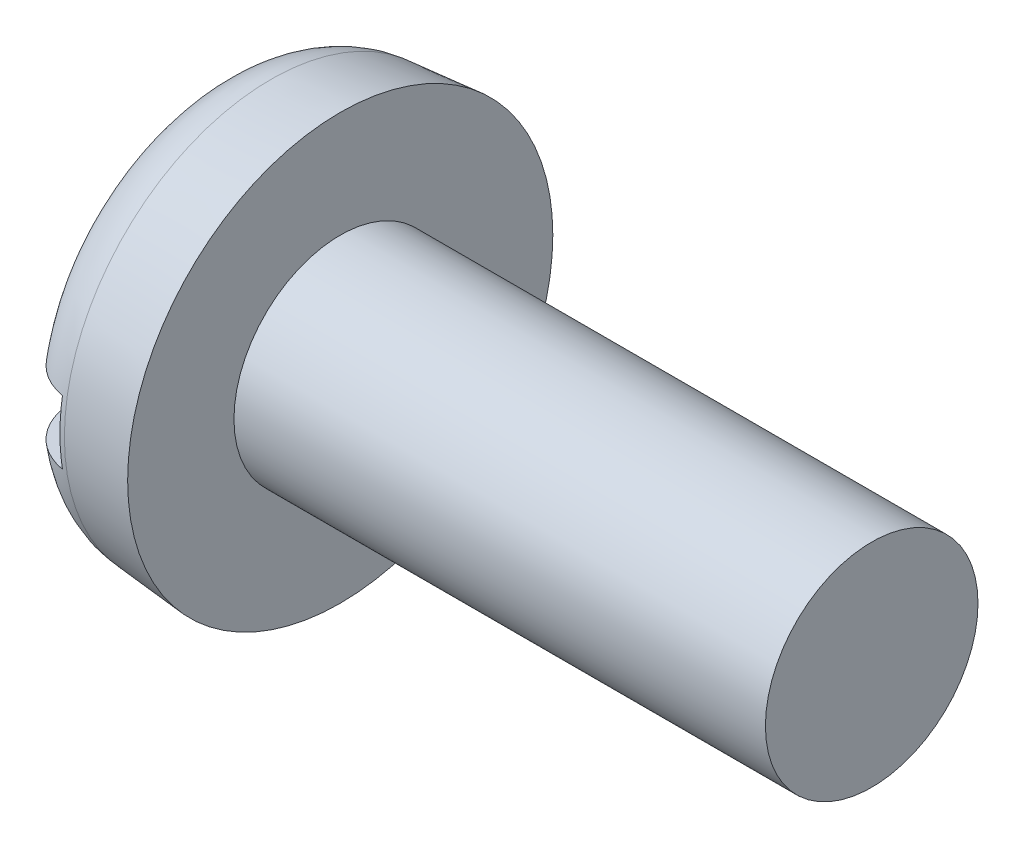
from build123d import *

# Parameters (mm, degrees)
FILLET2_R  = 1.2
SKETCH2_W  = 8
SKETCH2_H  = 1.2
SLOT_DEPTH = 1


with BuildPart() as part:
    # BodySke → Base-Revolve (revolve)
    with BuildSketch(Plane.XY, mode=Mode.PRIVATE) as base_revolve_sk:
        Polygon((2.4, 2), (2.4, 4), (0, 3.790027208), (0, 0), (12.4, 0), (12.4, 2), align=None)
    revolve(base_revolve_sk.sketch.rotate(Axis((-25.4, 0, 0), (1, 0, 0)), 90), axis=Axis((-25.4, 0, 0), (1, 0, 0)))

    # Fillet2
    fillet2_edges = [part.edges().sort_by_distance(p)[0] for p in [
        (0, 0, -3.790027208),
    ]]
    fillet(fillet2_edges, radius=FILLET2_R)

    # Sketch2 → Slot (cut)
    with BuildSketch(Plane(origin=(0, 0, 0), x_dir=(0, 0, -1), z_dir=(1, 0, 0))):
        Rectangle(SKETCH2_W, SKETCH2_H)
    extrude(amount=SLOT_DEPTH, mode=Mode.SUBTRACT)


solid = part.part
